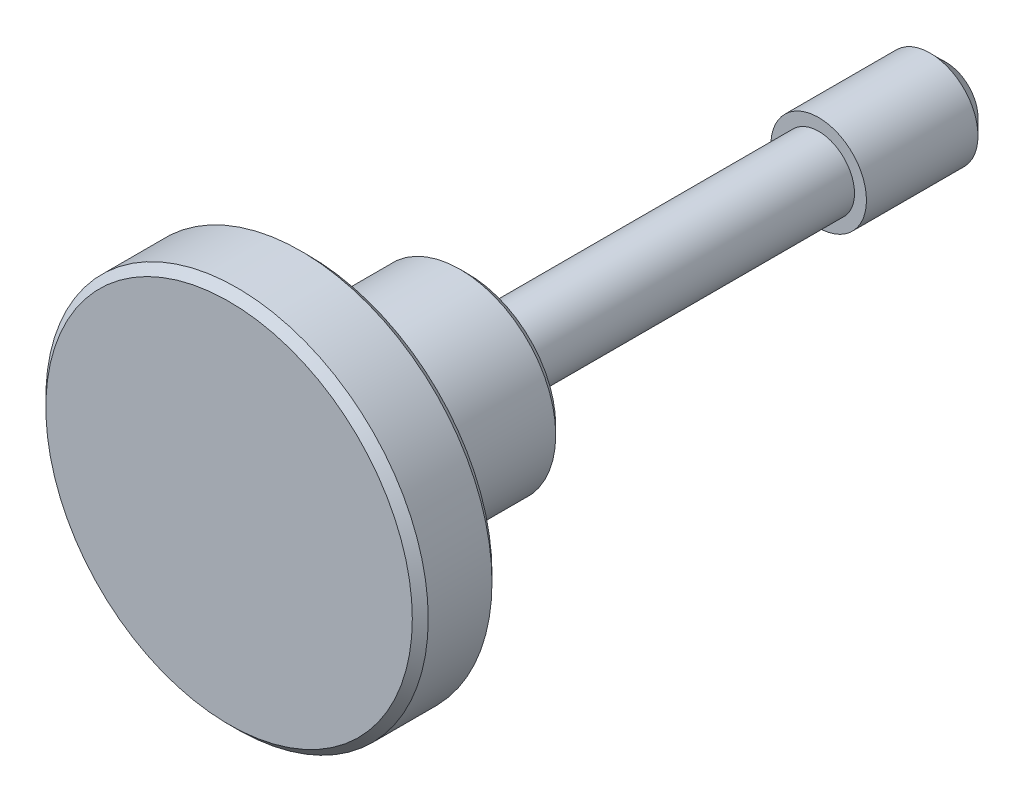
ISO-10303-21;
HEADER;
FILE_DESCRIPTION(('STEP AP214'),'2;1');
FILE_NAME('part.step','',(''),(''),'','','');
FILE_SCHEMA(('AUTOMOTIVE_DESIGN { 1 0 10303 214 1 1 1 1 }'));
ENDSEC;
DATA;
#1=APPLICATION_CONTEXT('core data for automotive mechanical design processes');
#2=APPLICATION_PROTOCOL_DEFINITION('international standard','automotive_design',2000,#1);
#3=PRODUCT_CONTEXT('',#1,'mechanical');
#4=PRODUCT('Part','Part','',(#3));
#5=PRODUCT_RELATED_PRODUCT_CATEGORY('part','',(#4));
#6=PRODUCT_DEFINITION_FORMATION('','',#4);
#7=PRODUCT_DEFINITION_CONTEXT('part definition',#1,'design');
#8=PRODUCT_DEFINITION('design','',#6,#7);
#9=PRODUCT_DEFINITION_SHAPE('','',#8);
#10=(LENGTH_UNIT() NAMED_UNIT(*) SI_UNIT(.MILLI.,.METRE.));
#11=(NAMED_UNIT(*) PLANE_ANGLE_UNIT() SI_UNIT($,.RADIAN.));
#12=(NAMED_UNIT(*) SI_UNIT($,.STERADIAN.) SOLID_ANGLE_UNIT());
#13=UNCERTAINTY_MEASURE_WITH_UNIT(LENGTH_MEASURE(1.E-05),#10,'distance_accuracy_value','');
#14=(GEOMETRIC_REPRESENTATION_CONTEXT(3) GLOBAL_UNCERTAINTY_ASSIGNED_CONTEXT((#13)) GLOBAL_UNIT_ASSIGNED_CONTEXT((#10,
#11,#12)) REPRESENTATION_CONTEXT('',''));
#15=CARTESIAN_POINT('',(0.,0.,0.));
#16=DIRECTION('',(0.,0.,1.));
#17=DIRECTION('',(1.,0.,0.));
#18=AXIS2_PLACEMENT_3D('',#15,#16,#17);
#19=CARTESIAN_POINT('',(0.,0.,9.));
#20=DIRECTION('',(0.,0.,1.));
#21=DIRECTION('',(1.,0.,0.));
#22=AXIS2_PLACEMENT_3D('',#19,#20,#21);
#23=TOROIDAL_SURFACE('',#22,7.,1.);
#24=CARTESIAN_POINT('',(0.,0.,10.));
#25=DIRECTION('',(0.,0.,1.));
#26=DIRECTION('',(1.,0.,0.));
#27=AXIS2_PLACEMENT_3D('',#24,#25,#26);
#28=CIRCLE('',#27,7.);
#29=CARTESIAN_POINT('',(7.,0.,10.));
#30=VERTEX_POINT('',#29);
#31=EDGE_CURVE('E8',#30,#30,#28,.T.);
#32=ORIENTED_EDGE('',*,*,#31,.F.);
#33=EDGE_LOOP('',(#32));
#34=FACE_BOUND('',#33,.T.);
#35=CARTESIAN_POINT('',(0.,0.,9.));
#36=DIRECTION('',(0.,0.,1.));
#37=DIRECTION('',(1.,0.,0.));
#38=AXIS2_PLACEMENT_3D('',#35,#36,#37);
#39=CIRCLE('',#38,6.);
#40=CARTESIAN_POINT('',(6.,0.,9.));
#41=VERTEX_POINT('',#40);
#42=EDGE_CURVE('E58',#41,#41,#39,.T.);
#43=ORIENTED_EDGE('',*,*,#42,.T.);
#44=EDGE_LOOP('',(#43));
#45=FACE_BOUND('',#44,.T.);
#46=ADVANCED_FACE('F12',(#34,#45),#23,.F.);
#47=CARTESIAN_POINT('',(0.,11.5,10.));
#48=DIRECTION('',(0.,0.,1.));
#49=DIRECTION('',(1.,0.,0.));
#50=AXIS2_PLACEMENT_3D('',#47,#48,#49);
#51=PLANE('',#50);
#52=CARTESIAN_POINT('',(0.,0.,10.));
#53=DIRECTION('',(0.,0.,1.));
#54=DIRECTION('',(1.,0.,0.));
#55=AXIS2_PLACEMENT_3D('',#52,#53,#54);
#56=CIRCLE('',#55,11.5);
#57=CARTESIAN_POINT('',(11.5,0.,10.));
#58=VERTEX_POINT('',#57);
#59=EDGE_CURVE('E18',#58,#58,#56,.T.);
#60=ORIENTED_EDGE('',*,*,#59,.F.);
#61=EDGE_LOOP('',(#60));
#62=FACE_BOUND('',#61,.T.);
#63=ORIENTED_EDGE('',*,*,#31,.T.);
#64=EDGE_LOOP('',(#63));
#65=FACE_BOUND('',#64,.T.);
#66=ADVANCED_FACE('F124',(#62,#65),#51,.F.);
#67=CARTESIAN_POINT('',(0.,0.,10.));
#68=DIRECTION('',(0.,0.,1.));
#69=DIRECTION('',(1.,0.,0.));
#70=AXIS2_PLACEMENT_3D('',#67,#68,#69);
#71=CONICAL_SURFACE('',#70,11.5,0.785398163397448);
#72=CARTESIAN_POINT('',(0.,0.,10.5));
#73=DIRECTION('',(0.,0.,1.));
#74=DIRECTION('',(1.,0.,0.));
#75=AXIS2_PLACEMENT_3D('',#72,#73,#74);
#76=CIRCLE('',#75,12.);
#77=CARTESIAN_POINT('',(12.,0.,10.5));
#78=VERTEX_POINT('',#77);
#79=EDGE_CURVE('E22',#78,#78,#76,.T.);
#80=ORIENTED_EDGE('',*,*,#79,.F.);
#81=EDGE_LOOP('',(#80));
#82=FACE_BOUND('',#81,.T.);
#83=ORIENTED_EDGE('',*,*,#59,.T.);
#84=EDGE_LOOP('',(#83));
#85=FACE_BOUND('',#84,.T.);
#86=ADVANCED_FACE('F130',(#82,#85),#71,.T.);
#87=CARTESIAN_POINT('',(0.,0.,15.));
#88=DIRECTION('',(0.,0.,1.));
#89=DIRECTION('',(1.,0.,0.));
#90=AXIS2_PLACEMENT_3D('',#87,#88,#89);
#91=CYLINDRICAL_SURFACE('',#90,12.);
#92=CARTESIAN_POINT('',(0.,0.,14.5));
#93=DIRECTION('',(0.,0.,1.));
#94=DIRECTION('',(1.,0.,0.));
#95=AXIS2_PLACEMENT_3D('',#92,#93,#94);
#96=CIRCLE('',#95,12.);
#97=CARTESIAN_POINT('',(12.,0.,14.5));
#98=VERTEX_POINT('',#97);
#99=EDGE_CURVE('E26',#98,#98,#96,.T.);
#100=ORIENTED_EDGE('',*,*,#99,.F.);
#101=EDGE_LOOP('',(#100));
#102=FACE_BOUND('',#101,.T.);
#103=ORIENTED_EDGE('',*,*,#79,.T.);
#104=EDGE_LOOP('',(#103));
#105=FACE_BOUND('',#104,.T.);
#106=ADVANCED_FACE('F136',(#102,#105),#91,.T.);
#107=CARTESIAN_POINT('',(0.,0.,14.5));
#108=DIRECTION('',(0.,0.,-1.));
#109=DIRECTION('',(-1.,0.,0.));
#110=AXIS2_PLACEMENT_3D('',#107,#108,#109);
#111=CONICAL_SURFACE('',#110,12.,0.785398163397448);
#112=CARTESIAN_POINT('',(0.,0.,15.));
#113=DIRECTION('',(0.,0.,1.));
#114=DIRECTION('',(1.,0.,0.));
#115=AXIS2_PLACEMENT_3D('',#112,#113,#114);
#116=CIRCLE('',#115,11.5);
#117=CARTESIAN_POINT('',(11.5,0.,15.));
#118=VERTEX_POINT('',#117);
#119=EDGE_CURVE('E31',#118,#118,#116,.T.);
#120=ORIENTED_EDGE('',*,*,#119,.F.);
#121=EDGE_LOOP('',(#120));
#122=FACE_BOUND('',#121,.T.);
#123=ORIENTED_EDGE('',*,*,#99,.T.);
#124=EDGE_LOOP('',(#123));
#125=FACE_BOUND('',#124,.T.);
#126=ADVANCED_FACE('F120',(#122,#125),#111,.T.);
#127=CARTESIAN_POINT('',(0.,11.5,15.));
#128=DIRECTION('',(0.,0.,-1.));
#129=DIRECTION('',(-1.,0.,0.));
#130=AXIS2_PLACEMENT_3D('',#127,#128,#129);
#131=PLANE('',#130);
#132=ORIENTED_EDGE('',*,*,#119,.T.);
#133=EDGE_LOOP('',(#132));
#134=FACE_BOUND('',#133,.T.);
#135=ADVANCED_FACE('F113',(#134),#131,.F.);
#136=CARTESIAN_POINT('',(0.,2.,-30.));
#137=DIRECTION('',(0.,0.,1.));
#138=DIRECTION('',(1.,0.,0.));
#139=AXIS2_PLACEMENT_3D('',#136,#137,#138);
#140=PLANE('',#139);
#141=CARTESIAN_POINT('',(0.,0.,-30.));
#142=DIRECTION('',(0.,0.,1.));
#143=DIRECTION('',(1.,0.,0.));
#144=AXIS2_PLACEMENT_3D('',#141,#142,#143);
#145=CIRCLE('',#144,2.);
#146=CARTESIAN_POINT('',(2.,0.,-30.));
#147=VERTEX_POINT('',#146);
#148=EDGE_CURVE('E34',#147,#147,#145,.T.);
#149=ORIENTED_EDGE('',*,*,#148,.F.);
#150=EDGE_LOOP('',(#149));
#151=FACE_BOUND('',#150,.T.);
#152=ADVANCED_FACE('F108',(#151),#140,.F.);
#153=CARTESIAN_POINT('',(0.,0.,-30.));
#154=DIRECTION('',(0.,0.,1.));
#155=DIRECTION('',(1.,0.,0.));
#156=AXIS2_PLACEMENT_3D('',#153,#154,#155);
#157=CONICAL_SURFACE('',#156,2.,0.785398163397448);
#158=CARTESIAN_POINT('',(0.,0.,-29.));
#159=DIRECTION('',(0.,0.,1.));
#160=DIRECTION('',(1.,0.,0.));
#161=AXIS2_PLACEMENT_3D('',#158,#159,#160);
#162=CIRCLE('',#161,3.);
#163=CARTESIAN_POINT('',(3.,0.,-29.));
#164=VERTEX_POINT('',#163);
#165=EDGE_CURVE('E37',#164,#164,#162,.T.);
#166=ORIENTED_EDGE('',*,*,#165,.F.);
#167=EDGE_LOOP('',(#166));
#168=FACE_BOUND('',#167,.T.);
#169=ORIENTED_EDGE('',*,*,#148,.T.);
#170=EDGE_LOOP('',(#169));
#171=FACE_BOUND('',#170,.T.);
#172=ADVANCED_FACE('F102',(#168,#171),#157,.T.);
#173=CARTESIAN_POINT('',(0.,0.,15.));
#174=DIRECTION('',(0.,0.,1.));
#175=DIRECTION('',(1.,0.,0.));
#176=AXIS2_PLACEMENT_3D('',#173,#174,#175);
#177=CYLINDRICAL_SURFACE('',#176,3.);
#178=CARTESIAN_POINT('',(0.,0.,-22.));
#179=DIRECTION('',(0.,0.,1.));
#180=DIRECTION('',(1.,0.,0.));
#181=AXIS2_PLACEMENT_3D('',#178,#179,#180);
#182=CIRCLE('',#181,3.);
#183=CARTESIAN_POINT('',(3.,0.,-22.));
#184=VERTEX_POINT('',#183);
#185=EDGE_CURVE('E40',#184,#184,#182,.T.);
#186=ORIENTED_EDGE('',*,*,#185,.F.);
#187=EDGE_LOOP('',(#186));
#188=FACE_BOUND('',#187,.T.);
#189=ORIENTED_EDGE('',*,*,#165,.T.);
#190=EDGE_LOOP('',(#189));
#191=FACE_BOUND('',#190,.T.);
#192=ADVANCED_FACE('F96',(#188,#191),#177,.T.);
#193=CARTESIAN_POINT('',(0.,3.,-22.));
#194=DIRECTION('',(0.,0.,-1.));
#195=DIRECTION('',(-1.,0.,0.));
#196=AXIS2_PLACEMENT_3D('',#193,#194,#195);
#197=PLANE('',#196);
#198=CARTESIAN_POINT('',(0.,0.,-22.));
#199=DIRECTION('',(0.,0.,1.));
#200=DIRECTION('',(1.,0.,0.));
#201=AXIS2_PLACEMENT_3D('',#198,#199,#200);
#202=CIRCLE('',#201,2.25);
#203=CARTESIAN_POINT('',(2.25,0.,-22.));
#204=VERTEX_POINT('',#203);
#205=EDGE_CURVE('E43',#204,#204,#202,.T.);
#206=ORIENTED_EDGE('',*,*,#205,.F.);
#207=EDGE_LOOP('',(#206));
#208=FACE_BOUND('',#207,.T.);
#209=ORIENTED_EDGE('',*,*,#185,.T.);
#210=EDGE_LOOP('',(#209));
#211=FACE_BOUND('',#210,.T.);
#212=ADVANCED_FACE('F90',(#208,#211),#197,.F.);
#213=CARTESIAN_POINT('',(0.,0.,15.));
#214=DIRECTION('',(0.,0.,1.));
#215=DIRECTION('',(1.,0.,0.));
#216=AXIS2_PLACEMENT_3D('',#213,#214,#215);
#217=CYLINDRICAL_SURFACE('',#216,2.25);
#218=CARTESIAN_POINT('',(0.,0.,-0.500000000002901));
#219=DIRECTION('',(0.,0.,1.));
#220=DIRECTION('',(1.,0.,0.));
#221=AXIS2_PLACEMENT_3D('',#218,#219,#220);
#222=CIRCLE('',#221,2.25);
#223=CARTESIAN_POINT('',(2.25,0.,-0.500000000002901));
#224=VERTEX_POINT('',#223);
#225=EDGE_CURVE('E46',#224,#224,#222,.T.);
#226=ORIENTED_EDGE('',*,*,#225,.F.);
#227=EDGE_LOOP('',(#226));
#228=FACE_BOUND('',#227,.T.);
#229=ORIENTED_EDGE('',*,*,#205,.T.);
#230=EDGE_LOOP('',(#229));
#231=FACE_BOUND('',#230,.T.);
#232=ADVANCED_FACE('F84',(#228,#231),#217,.T.);
#233=CARTESIAN_POINT('',(0.,0.,-0.5));
#234=DIRECTION('',(0.,0.,1.));
#235=DIRECTION('',(1.,0.,0.));
#236=AXIS2_PLACEMENT_3D('',#233,#234,#235);
#237=TOROIDAL_SURFACE('',#236,2.75,0.5);
#238=CARTESIAN_POINT('',(0.,0.,0.));
#239=DIRECTION('',(0.,0.,1.));
#240=DIRECTION('',(1.,0.,0.));
#241=AXIS2_PLACEMENT_3D('',#238,#239,#240);
#242=CIRCLE('',#241,2.75);
#243=CARTESIAN_POINT('',(2.75,0.,0.));
#244=VERTEX_POINT('',#243);
#245=EDGE_CURVE('E49',#244,#244,#242,.T.);
#246=ORIENTED_EDGE('',*,*,#245,.F.);
#247=EDGE_LOOP('',(#246));
#248=FACE_BOUND('',#247,.T.);
#249=ORIENTED_EDGE('',*,*,#225,.T.);
#250=EDGE_LOOP('',(#249));
#251=FACE_BOUND('',#250,.T.);
#252=ADVANCED_FACE('F78',(#248,#251),#237,.F.);
#253=CARTESIAN_POINT('',(0.,5.5,0.));
#254=DIRECTION('',(0.,0.,1.));
#255=DIRECTION('',(1.,0.,0.));
#256=AXIS2_PLACEMENT_3D('',#253,#254,#255);
#257=PLANE('',#256);
#258=CARTESIAN_POINT('',(0.,0.,0.));
#259=DIRECTION('',(0.,0.,1.));
#260=DIRECTION('',(1.,0.,0.));
#261=AXIS2_PLACEMENT_3D('',#258,#259,#260);
#262=CIRCLE('',#261,5.5);
#263=CARTESIAN_POINT('',(5.5,0.,0.));
#264=VERTEX_POINT('',#263);
#265=EDGE_CURVE('E52',#264,#264,#262,.T.);
#266=ORIENTED_EDGE('',*,*,#265,.F.);
#267=EDGE_LOOP('',(#266));
#268=FACE_BOUND('',#267,.T.);
#269=ORIENTED_EDGE('',*,*,#245,.T.);
#270=EDGE_LOOP('',(#269));
#271=FACE_BOUND('',#270,.T.);
#272=ADVANCED_FACE('F72',(#268,#271),#257,.F.);
#273=CARTESIAN_POINT('',(0.,0.,0.));
#274=DIRECTION('',(0.,0.,1.));
#275=DIRECTION('',(1.,0.,0.));
#276=AXIS2_PLACEMENT_3D('',#273,#274,#275);
#277=CONICAL_SURFACE('',#276,5.5,0.785398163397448);
#278=CARTESIAN_POINT('',(0.,0.,0.5));
#279=DIRECTION('',(0.,0.,1.));
#280=DIRECTION('',(1.,0.,0.));
#281=AXIS2_PLACEMENT_3D('',#278,#279,#280);
#282=CIRCLE('',#281,6.);
#283=CARTESIAN_POINT('',(6.,0.,0.5));
#284=VERTEX_POINT('',#283);
#285=EDGE_CURVE('E55',#284,#284,#282,.T.);
#286=ORIENTED_EDGE('',*,*,#285,.F.);
#287=EDGE_LOOP('',(#286));
#288=FACE_BOUND('',#287,.T.);
#289=ORIENTED_EDGE('',*,*,#265,.T.);
#290=EDGE_LOOP('',(#289));
#291=FACE_BOUND('',#290,.T.);
#292=ADVANCED_FACE('F66',(#288,#291),#277,.T.);
#293=CARTESIAN_POINT('',(0.,0.,15.));
#294=DIRECTION('',(0.,0.,1.));
#295=DIRECTION('',(1.,0.,0.));
#296=AXIS2_PLACEMENT_3D('',#293,#294,#295);
#297=CYLINDRICAL_SURFACE('',#296,6.);
#298=ORIENTED_EDGE('',*,*,#42,.F.);
#299=EDGE_LOOP('',(#298));
#300=FACE_BOUND('',#299,.T.);
#301=ORIENTED_EDGE('',*,*,#285,.T.);
#302=EDGE_LOOP('',(#301));
#303=FACE_BOUND('',#302,.T.);
#304=ADVANCED_FACE('F63',(#300,#303),#297,.T.);
#305=CLOSED_SHELL('',(#46,#66,#86,#106,#126,#135,#152,#172,#192,#212,#232,#252,#272,#292,#304));
#306=MANIFOLD_SOLID_BREP('B1',#305);
#307=ADVANCED_BREP_SHAPE_REPRESENTATION('',(#18,#306),#14);
#308=SHAPE_DEFINITION_REPRESENTATION(#9,#307);
ENDSEC;
END-ISO-10303-21;
